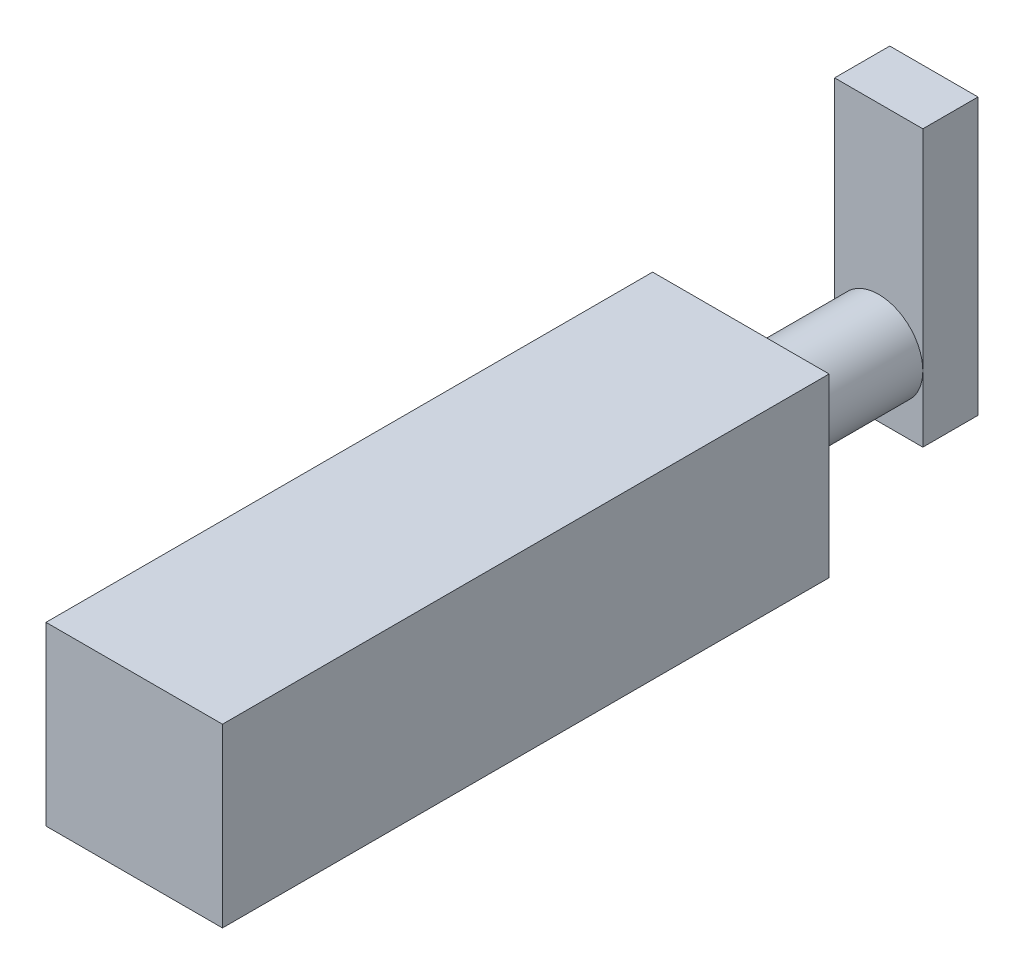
ISO-10303-21;
HEADER;
FILE_DESCRIPTION(('STEP AP214'),'2;1');
FILE_NAME('part.step','',(''),(''),'','','');
FILE_SCHEMA(('AUTOMOTIVE_DESIGN { 1 0 10303 214 1 1 1 1 }'));
ENDSEC;
DATA;
#1=APPLICATION_CONTEXT('core data for automotive mechanical design processes');
#2=APPLICATION_PROTOCOL_DEFINITION('international standard','automotive_design',2000,#1);
#3=PRODUCT_CONTEXT('',#1,'mechanical');
#4=PRODUCT('Part','Part','',(#3));
#5=PRODUCT_RELATED_PRODUCT_CATEGORY('part','',(#4));
#6=PRODUCT_DEFINITION_FORMATION('','',#4);
#7=PRODUCT_DEFINITION_CONTEXT('part definition',#1,'design');
#8=PRODUCT_DEFINITION('design','',#6,#7);
#9=PRODUCT_DEFINITION_SHAPE('','',#8);
#10=(LENGTH_UNIT() NAMED_UNIT(*) SI_UNIT(.MILLI.,.METRE.));
#11=(NAMED_UNIT(*) PLANE_ANGLE_UNIT() SI_UNIT($,.RADIAN.));
#12=(NAMED_UNIT(*) SI_UNIT($,.STERADIAN.) SOLID_ANGLE_UNIT());
#13=UNCERTAINTY_MEASURE_WITH_UNIT(LENGTH_MEASURE(1.E-05),#10,'distance_accuracy_value','');
#14=(GEOMETRIC_REPRESENTATION_CONTEXT(3) GLOBAL_UNCERTAINTY_ASSIGNED_CONTEXT((#13)) GLOBAL_UNIT_ASSIGNED_CONTEXT((#10,
#11,#12)) REPRESENTATION_CONTEXT('',''));
#15=CARTESIAN_POINT('',(0.,0.,0.));
#16=DIRECTION('',(0.,0.,1.));
#17=DIRECTION('',(1.,0.,0.));
#18=AXIS2_PLACEMENT_3D('',#15,#16,#17);
#19=CARTESIAN_POINT('',(0.,0.,80.));
#20=DIRECTION('',(0.,0.,-1.));
#21=DIRECTION('',(-1.,0.,0.));
#22=AXIS2_PLACEMENT_3D('',#19,#20,#21);
#23=CYLINDRICAL_SURFACE('',#22,8.);
#24=CARTESIAN_POINT('',(0.,0.,0.));
#25=DIRECTION('',(0.,0.,1.));
#26=DIRECTION('',(1.,0.,0.));
#27=AXIS2_PLACEMENT_3D('',#24,#25,#26);
#28=CIRCLE('',#27,8.);
#29=CARTESIAN_POINT('',(8.,0.,0.));
#30=VERTEX_POINT('',#29);
#31=CARTESIAN_POINT('',(-8.,0.,0.));
#32=VERTEX_POINT('',#31);
#33=EDGE_CURVE('E40',#30,#32,#28,.T.);
#34=ORIENTED_EDGE('',*,*,#33,.T.);
#35=EDGE_CURVE('E54',#32,#30,#28,.T.);
#36=ORIENTED_EDGE('',*,*,#35,.T.);
#37=EDGE_LOOP('',(#34,#36));
#38=FACE_BOUND('',#37,.T.);
#39=CARTESIAN_POINT('',(0.,0.,25.));
#40=DIRECTION('',(0.,0.,1.));
#41=DIRECTION('',(1.,0.,0.));
#42=AXIS2_PLACEMENT_3D('',#39,#40,#41);
#43=CIRCLE('',#42,8.);
#44=CARTESIAN_POINT('',(8.,0.,25.));
#45=VERTEX_POINT('',#44);
#46=EDGE_CURVE('E11',#45,#45,#43,.T.);
#47=ORIENTED_EDGE('',*,*,#46,.F.);
#48=EDGE_LOOP('',(#47));
#49=FACE_BOUND('',#48,.T.);
#50=ADVANCED_FACE('F33',(#38,#49),#23,.T.);
#51=CARTESIAN_POINT('',(8.,38.,0.));
#52=DIRECTION('',(0.,0.,1.));
#53=DIRECTION('',(1.,0.,0.));
#54=AXIS2_PLACEMENT_3D('',#51,#52,#53);
#55=PLANE('',#54);
#56=ORIENTED_EDGE('',*,*,#33,.F.);
#57=DIRECTION('',(0.,-1.,0.));
#58=VECTOR('',#57,1.);
#59=CARTESIAN_POINT('',(8.,-12.,0.));
#60=LINE('',#59,#58);
#61=CARTESIAN_POINT('',(8.,38.,0.));
#62=VERTEX_POINT('',#61);
#63=EDGE_CURVE('E47',#62,#30,#60,.T.);
#64=ORIENTED_EDGE('',*,*,#63,.F.);
#65=DIRECTION('',(1.,0.,0.));
#66=VECTOR('',#65,1.);
#67=CARTESIAN_POINT('',(8.,38.,0.));
#68=LINE('',#67,#66);
#69=CARTESIAN_POINT('',(-8.,38.,0.));
#70=VERTEX_POINT('',#69);
#71=EDGE_CURVE('E153',#70,#62,#68,.T.);
#72=ORIENTED_EDGE('',*,*,#71,.F.);
#73=DIRECTION('',(0.,1.,0.));
#74=VECTOR('',#73,1.);
#75=CARTESIAN_POINT('',(-8.,-12.,0.));
#76=LINE('',#75,#74);
#77=EDGE_CURVE('E163',#32,#70,#76,.T.);
#78=ORIENTED_EDGE('',*,*,#77,.F.);
#79=EDGE_LOOP('',(#56,#64,#72,#78));
#80=FACE_BOUND('',#79,.T.);
#81=ADVANCED_FACE('F182',(#80),#55,.T.);
#82=ORIENTED_EDGE('',*,*,#35,.F.);
#83=CARTESIAN_POINT('',(-8.,-12.,0.));
#84=VERTEX_POINT('',#83);
#85=EDGE_CURVE('E164',#84,#32,#76,.T.);
#86=ORIENTED_EDGE('',*,*,#85,.F.);
#87=DIRECTION('',(-1.,0.,0.));
#88=VECTOR('',#87,1.);
#89=CARTESIAN_POINT('',(8.,-12.,0.));
#90=LINE('',#89,#88);
#91=CARTESIAN_POINT('',(8.,-12.,0.));
#92=VERTEX_POINT('',#91);
#93=EDGE_CURVE('E161',#92,#84,#90,.T.);
#94=ORIENTED_EDGE('',*,*,#93,.F.);
#95=EDGE_CURVE('E145',#30,#92,#60,.T.);
#96=ORIENTED_EDGE('',*,*,#95,.F.);
#97=EDGE_LOOP('',(#82,#86,#94,#96));
#98=FACE_BOUND('',#97,.T.);
#99=ADVANCED_FACE('F212',(#98),#55,.T.);
#100=CARTESIAN_POINT('',(8.,-12.,-10.));
#101=DIRECTION('',(-1.,0.,0.));
#102=DIRECTION('',(0.,0.,1.));
#103=AXIS2_PLACEMENT_3D('',#100,#101,#102);
#104=PLANE('',#103);
#105=ORIENTED_EDGE('',*,*,#63,.T.);
#106=ORIENTED_EDGE('',*,*,#95,.T.);
#107=DIRECTION('',(0.,0.,1.));
#108=VECTOR('',#107,1.);
#109=CARTESIAN_POINT('',(8.,-12.,-10.));
#110=LINE('',#109,#108);
#111=CARTESIAN_POINT('',(8.,-12.,-10.));
#112=VERTEX_POINT('',#111);
#113=EDGE_CURVE('E175',#112,#92,#110,.T.);
#114=ORIENTED_EDGE('',*,*,#113,.F.);
#115=DIRECTION('',(0.,-1.,0.));
#116=VECTOR('',#115,1.);
#117=CARTESIAN_POINT('',(8.,-12.,-10.));
#118=LINE('',#117,#116);
#119=CARTESIAN_POINT('',(8.,38.,-10.));
#120=VERTEX_POINT('',#119);
#121=EDGE_CURVE('E149',#120,#112,#118,.T.);
#122=ORIENTED_EDGE('',*,*,#121,.F.);
#123=DIRECTION('',(0.,0.,1.));
#124=VECTOR('',#123,1.);
#125=CARTESIAN_POINT('',(8.,38.,-10.));
#126=LINE('',#125,#124);
#127=EDGE_CURVE('E159',#120,#62,#126,.T.);
#128=ORIENTED_EDGE('',*,*,#127,.T.);
#129=EDGE_LOOP('',(#105,#106,#114,#122,#128));
#130=FACE_BOUND('',#129,.T.);
#131=ADVANCED_FACE('F223',(#130),#104,.F.);
#132=CARTESIAN_POINT('',(8.,-12.,-10.));
#133=DIRECTION('',(0.,1.,0.));
#134=DIRECTION('',(0.,0.,1.));
#135=AXIS2_PLACEMENT_3D('',#132,#133,#134);
#136=PLANE('',#135);
#137=ORIENTED_EDGE('',*,*,#93,.T.);
#138=DIRECTION('',(0.,0.,1.));
#139=VECTOR('',#138,1.);
#140=CARTESIAN_POINT('',(-8.,-12.,-10.));
#141=LINE('',#140,#139);
#142=CARTESIAN_POINT('',(-8.,-12.,-10.));
#143=VERTEX_POINT('',#142);
#144=EDGE_CURVE('E172',#143,#84,#141,.T.);
#145=ORIENTED_EDGE('',*,*,#144,.F.);
#146=DIRECTION('',(-1.,0.,0.));
#147=VECTOR('',#146,1.);
#148=CARTESIAN_POINT('',(8.,-12.,-10.));
#149=LINE('',#148,#147);
#150=EDGE_CURVE('E152',#112,#143,#149,.T.);
#151=ORIENTED_EDGE('',*,*,#150,.F.);
#152=ORIENTED_EDGE('',*,*,#113,.T.);
#153=EDGE_LOOP('',(#137,#145,#151,#152));
#154=FACE_BOUND('',#153,.T.);
#155=ADVANCED_FACE('F220',(#154),#136,.F.);
#156=CARTESIAN_POINT('',(-8.,-12.,-10.));
#157=DIRECTION('',(1.,0.,0.));
#158=DIRECTION('',(0.,0.,-1.));
#159=AXIS2_PLACEMENT_3D('',#156,#157,#158);
#160=PLANE('',#159);
#161=ORIENTED_EDGE('',*,*,#85,.T.);
#162=ORIENTED_EDGE('',*,*,#77,.T.);
#163=DIRECTION('',(0.,0.,1.));
#164=VECTOR('',#163,1.);
#165=CARTESIAN_POINT('',(-8.,38.,-10.));
#166=LINE('',#165,#164);
#167=CARTESIAN_POINT('',(-8.,38.,-10.));
#168=VERTEX_POINT('',#167);
#169=EDGE_CURVE('E169',#168,#70,#166,.T.);
#170=ORIENTED_EDGE('',*,*,#169,.F.);
#171=DIRECTION('',(0.,1.,0.));
#172=VECTOR('',#171,1.);
#173=CARTESIAN_POINT('',(-8.,-12.,-10.));
#174=LINE('',#173,#172);
#175=EDGE_CURVE('E155',#143,#168,#174,.T.);
#176=ORIENTED_EDGE('',*,*,#175,.F.);
#177=ORIENTED_EDGE('',*,*,#144,.T.);
#178=EDGE_LOOP('',(#161,#162,#170,#176,#177));
#179=FACE_BOUND('',#178,.T.);
#180=ADVANCED_FACE('F216',(#179),#160,.F.);
#181=CARTESIAN_POINT('',(8.,38.,-10.));
#182=DIRECTION('',(0.,-1.,0.));
#183=DIRECTION('',(0.,0.,-1.));
#184=AXIS2_PLACEMENT_3D('',#181,#182,#183);
#185=PLANE('',#184);
#186=ORIENTED_EDGE('',*,*,#71,.T.);
#187=ORIENTED_EDGE('',*,*,#127,.F.);
#188=DIRECTION('',(1.,0.,0.));
#189=VECTOR('',#188,1.);
#190=CARTESIAN_POINT('',(8.,38.,-10.));
#191=LINE('',#190,#189);
#192=EDGE_CURVE('E157',#168,#120,#191,.T.);
#193=ORIENTED_EDGE('',*,*,#192,.F.);
#194=ORIENTED_EDGE('',*,*,#169,.T.);
#195=EDGE_LOOP('',(#186,#187,#193,#194));
#196=FACE_BOUND('',#195,.T.);
#197=ADVANCED_FACE('F193',(#196),#185,.F.);
#198=CARTESIAN_POINT('',(8.,38.,-10.));
#199=DIRECTION('',(0.,0.,1.));
#200=DIRECTION('',(1.,0.,0.));
#201=AXIS2_PLACEMENT_3D('',#198,#199,#200);
#202=PLANE('',#201);
#203=ORIENTED_EDGE('',*,*,#121,.T.);
#204=ORIENTED_EDGE('',*,*,#150,.T.);
#205=ORIENTED_EDGE('',*,*,#175,.T.);
#206=ORIENTED_EDGE('',*,*,#192,.T.);
#207=EDGE_LOOP('',(#203,#204,#205,#206));
#208=FACE_BOUND('',#207,.T.);
#209=ADVANCED_FACE('F185',(#208),#202,.F.);
#210=CARTESIAN_POINT('',(-16.,-16.,25.));
#211=DIRECTION('',(0.,0.,1.));
#212=DIRECTION('',(1.,0.,0.));
#213=AXIS2_PLACEMENT_3D('',#210,#211,#212);
#214=PLANE('',#213);
#215=DIRECTION('',(0.,-1.,0.));
#216=VECTOR('',#215,1.);
#217=CARTESIAN_POINT('',(-16.,16.,25.));
#218=LINE('',#217,#216);
#219=CARTESIAN_POINT('',(-16.,16.,25.));
#220=VERTEX_POINT('',#219);
#221=CARTESIAN_POINT('',(-16.,-16.,25.));
#222=VERTEX_POINT('',#221);
#223=EDGE_CURVE('E124',#220,#222,#218,.T.);
#224=ORIENTED_EDGE('',*,*,#223,.F.);
#225=DIRECTION('',(-1.,0.,0.));
#226=VECTOR('',#225,1.);
#227=CARTESIAN_POINT('',(-16.,16.,25.));
#228=LINE('',#227,#226);
#229=CARTESIAN_POINT('',(16.,16.,25.));
#230=VERTEX_POINT('',#229);
#231=EDGE_CURVE('E116',#230,#220,#228,.T.);
#232=ORIENTED_EDGE('',*,*,#231,.F.);
#233=DIRECTION('',(0.,1.,0.));
#234=VECTOR('',#233,1.);
#235=CARTESIAN_POINT('',(16.,16.,25.));
#236=LINE('',#235,#234);
#237=CARTESIAN_POINT('',(16.,-16.,25.));
#238=VERTEX_POINT('',#237);
#239=EDGE_CURVE('E127',#238,#230,#236,.T.);
#240=ORIENTED_EDGE('',*,*,#239,.F.);
#241=DIRECTION('',(1.,0.,0.));
#242=VECTOR('',#241,1.);
#243=CARTESIAN_POINT('',(-16.,-16.,25.));
#244=LINE('',#243,#242);
#245=EDGE_CURVE('E108',#222,#238,#244,.T.);
#246=ORIENTED_EDGE('',*,*,#245,.F.);
#247=EDGE_LOOP('',(#224,#232,#240,#246));
#248=FACE_BOUND('',#247,.T.);
#249=ORIENTED_EDGE('',*,*,#46,.T.);
#250=EDGE_LOOP('',(#249));
#251=FACE_BOUND('',#250,.T.);
#252=ADVANCED_FACE('F121',(#248,#251),#214,.F.);
#253=CARTESIAN_POINT('',(-16.,16.,25.));
#254=DIRECTION('',(-1.,0.,0.));
#255=DIRECTION('',(0.,-1.,0.));
#256=AXIS2_PLACEMENT_3D('',#253,#254,#255);
#257=PLANE('',#256);
#258=DIRECTION('',(0.,-1.,0.));
#259=VECTOR('',#258,1.);
#260=CARTESIAN_POINT('',(-16.,16.,135.));
#261=LINE('',#260,#259);
#262=CARTESIAN_POINT('',(-16.,16.,135.));
#263=VERTEX_POINT('',#262);
#264=CARTESIAN_POINT('',(-16.,-16.,135.));
#265=VERTEX_POINT('',#264);
#266=EDGE_CURVE('E139',#263,#265,#261,.T.);
#267=ORIENTED_EDGE('',*,*,#266,.F.);
#268=DIRECTION('',(0.,0.,1.));
#269=VECTOR('',#268,1.);
#270=CARTESIAN_POINT('',(-16.,16.,25.));
#271=LINE('',#270,#269);
#272=EDGE_CURVE('E130',#220,#263,#271,.T.);
#273=ORIENTED_EDGE('',*,*,#272,.F.);
#274=ORIENTED_EDGE('',*,*,#223,.T.);
#275=DIRECTION('',(0.,0.,1.));
#276=VECTOR('',#275,1.);
#277=CARTESIAN_POINT('',(-16.,-16.,25.));
#278=LINE('',#277,#276);
#279=EDGE_CURVE('E105',#222,#265,#278,.T.);
#280=ORIENTED_EDGE('',*,*,#279,.T.);
#281=EDGE_LOOP('',(#267,#273,#274,#280));
#282=FACE_BOUND('',#281,.T.);
#283=ADVANCED_FACE('F129',(#282),#257,.T.);
#284=CARTESIAN_POINT('',(-16.,16.,25.));
#285=DIRECTION('',(0.,1.,0.));
#286=DIRECTION('',(0.,0.,1.));
#287=AXIS2_PLACEMENT_3D('',#284,#285,#286);
#288=PLANE('',#287);
#289=DIRECTION('',(-1.,0.,0.));
#290=VECTOR('',#289,1.);
#291=CARTESIAN_POINT('',(-16.,16.,135.));
#292=LINE('',#291,#290);
#293=CARTESIAN_POINT('',(16.,16.,135.));
#294=VERTEX_POINT('',#293);
#295=EDGE_CURVE('E131',#294,#263,#292,.T.);
#296=ORIENTED_EDGE('',*,*,#295,.F.);
#297=DIRECTION('',(0.,0.,1.));
#298=VECTOR('',#297,1.);
#299=CARTESIAN_POINT('',(16.,16.,25.));
#300=LINE('',#299,#298);
#301=EDGE_CURVE('E146',#230,#294,#300,.T.);
#302=ORIENTED_EDGE('',*,*,#301,.F.);
#303=ORIENTED_EDGE('',*,*,#231,.T.);
#304=ORIENTED_EDGE('',*,*,#272,.T.);
#305=EDGE_LOOP('',(#296,#302,#303,#304));
#306=FACE_BOUND('',#305,.T.);
#307=ADVANCED_FACE('F191',(#306),#288,.T.);
#308=CARTESIAN_POINT('',(16.,16.,25.));
#309=DIRECTION('',(1.,0.,0.));
#310=DIRECTION('',(0.,0.,-1.));
#311=AXIS2_PLACEMENT_3D('',#308,#309,#310);
#312=PLANE('',#311);
#313=DIRECTION('',(0.,1.,0.));
#314=VECTOR('',#313,1.);
#315=CARTESIAN_POINT('',(16.,16.,135.));
#316=LINE('',#315,#314);
#317=CARTESIAN_POINT('',(16.,-16.,135.));
#318=VERTEX_POINT('',#317);
#319=EDGE_CURVE('E134',#318,#294,#316,.T.);
#320=ORIENTED_EDGE('',*,*,#319,.F.);
#321=DIRECTION('',(0.,0.,1.));
#322=VECTOR('',#321,1.);
#323=CARTESIAN_POINT('',(16.,-16.,25.));
#324=LINE('',#323,#322);
#325=EDGE_CURVE('E115',#238,#318,#324,.T.);
#326=ORIENTED_EDGE('',*,*,#325,.F.);
#327=ORIENTED_EDGE('',*,*,#239,.T.);
#328=ORIENTED_EDGE('',*,*,#301,.T.);
#329=EDGE_LOOP('',(#320,#326,#327,#328));
#330=FACE_BOUND('',#329,.T.);
#331=ADVANCED_FACE('F203',(#330),#312,.T.);
#332=CARTESIAN_POINT('',(-16.,-16.,25.));
#333=DIRECTION('',(0.,-1.,0.));
#334=DIRECTION('',(0.,0.,-1.));
#335=AXIS2_PLACEMENT_3D('',#332,#333,#334);
#336=PLANE('',#335);
#337=DIRECTION('',(1.,0.,0.));
#338=VECTOR('',#337,1.);
#339=CARTESIAN_POINT('',(-16.,-16.,135.));
#340=LINE('',#339,#338);
#341=EDGE_CURVE('E110',#265,#318,#340,.T.);
#342=ORIENTED_EDGE('',*,*,#341,.F.);
#343=ORIENTED_EDGE('',*,*,#279,.F.);
#344=ORIENTED_EDGE('',*,*,#245,.T.);
#345=ORIENTED_EDGE('',*,*,#325,.T.);
#346=EDGE_LOOP('',(#342,#343,#344,#345));
#347=FACE_BOUND('',#346,.T.);
#348=ADVANCED_FACE('F107',(#347),#336,.T.);
#349=CARTESIAN_POINT('',(-16.,-16.,135.));
#350=DIRECTION('',(0.,0.,1.));
#351=DIRECTION('',(1.,0.,0.));
#352=AXIS2_PLACEMENT_3D('',#349,#350,#351);
#353=PLANE('',#352);
#354=ORIENTED_EDGE('',*,*,#266,.T.);
#355=ORIENTED_EDGE('',*,*,#341,.T.);
#356=ORIENTED_EDGE('',*,*,#319,.T.);
#357=ORIENTED_EDGE('',*,*,#295,.T.);
#358=EDGE_LOOP('',(#354,#355,#356,#357));
#359=FACE_BOUND('',#358,.T.);
#360=ADVANCED_FACE('F197',(#359),#353,.T.);
#361=CLOSED_SHELL('',(#50,#81,#99,#131,#155,#180,#197,#209,#252,#283,#307,#331,#348,#360));
#362=MANIFOLD_SOLID_BREP('B2',#361);
#363=ADVANCED_BREP_SHAPE_REPRESENTATION('',(#18,#362),#14);
#364=SHAPE_DEFINITION_REPRESENTATION(#9,#363);
ENDSEC;
END-ISO-10303-21;
